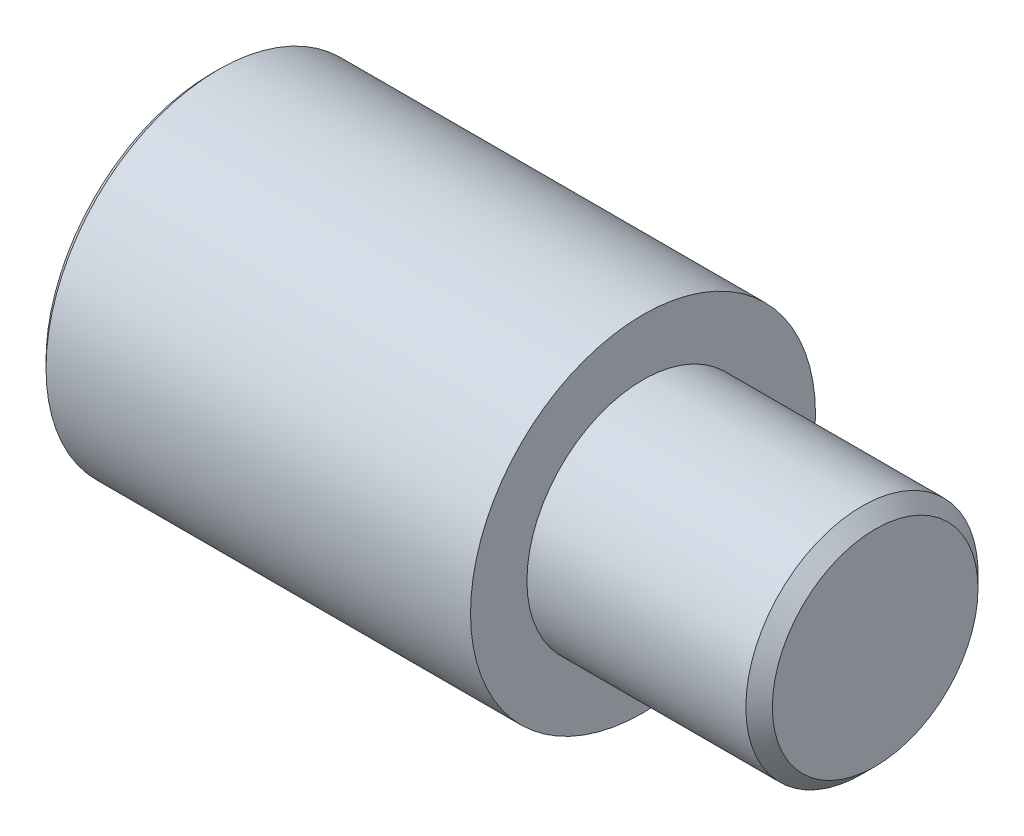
ISO-10303-21;
HEADER;
FILE_DESCRIPTION(('STEP AP214'),'2;1');
FILE_NAME('part.step','',(''),(''),'','','');
FILE_SCHEMA(('AUTOMOTIVE_DESIGN { 1 0 10303 214 1 1 1 1 }'));
ENDSEC;
DATA;
#1=APPLICATION_CONTEXT('core data for automotive mechanical design processes');
#2=APPLICATION_PROTOCOL_DEFINITION('international standard','automotive_design',2000,#1);
#3=PRODUCT_CONTEXT('',#1,'mechanical');
#4=PRODUCT('Part','Part','',(#3));
#5=PRODUCT_RELATED_PRODUCT_CATEGORY('part','',(#4));
#6=PRODUCT_DEFINITION_FORMATION('','',#4);
#7=PRODUCT_DEFINITION_CONTEXT('part definition',#1,'design');
#8=PRODUCT_DEFINITION('design','',#6,#7);
#9=PRODUCT_DEFINITION_SHAPE('','',#8);
#10=(LENGTH_UNIT() NAMED_UNIT(*) SI_UNIT(.MILLI.,.METRE.));
#11=(NAMED_UNIT(*) PLANE_ANGLE_UNIT() SI_UNIT($,.RADIAN.));
#12=(NAMED_UNIT(*) SI_UNIT($,.STERADIAN.) SOLID_ANGLE_UNIT());
#13=UNCERTAINTY_MEASURE_WITH_UNIT(LENGTH_MEASURE(1.E-05),#10,'distance_accuracy_value','');
#14=(GEOMETRIC_REPRESENTATION_CONTEXT(3) GLOBAL_UNCERTAINTY_ASSIGNED_CONTEXT((#13)) GLOBAL_UNIT_ASSIGNED_CONTEXT((#10,
#11,#12)) REPRESENTATION_CONTEXT('',''));
#15=CARTESIAN_POINT('',(0.,0.,0.));
#16=DIRECTION('',(0.,0.,1.));
#17=DIRECTION('',(1.,0.,0.));
#18=AXIS2_PLACEMENT_3D('',#15,#16,#17);
#19=CARTESIAN_POINT('',(2.50000000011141,0.,0.));
#20=DIRECTION('',(-1.,0.,0.));
#21=DIRECTION('',(0.,0.,1.));
#22=AXIS2_PLACEMENT_3D('',#19,#20,#21);
#23=CONICAL_SURFACE('',#22,1.99999999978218,1.0297442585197);
#24=CARTESIAN_POINT('',(3.70172123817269,0.,-2.55795384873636E-10));
#25=VERTEX_POINT('',#24);
#26=VERTEX_LOOP('',#25);
#27=FACE_BOUND('',#26,.T.);
#28=CARTESIAN_POINT('',(2.5,0.,0.));
#29=DIRECTION('',(-1.,0.,0.));
#30=DIRECTION('',(0.,0.,1.));
#31=AXIS2_PLACEMENT_3D('',#28,#29,#30);
#32=CIRCLE('',#31,2.);
#33=CARTESIAN_POINT('',(2.5,0.,2.));
#34=VERTEX_POINT('',#33);
#35=EDGE_CURVE('E35',#34,#34,#32,.T.);
#36=ORIENTED_EDGE('',*,*,#35,.T.);
#37=EDGE_LOOP('',(#36));
#38=FACE_BOUND('',#37,.T.);
#39=ADVANCED_FACE('F17',(#27,#38),#23,.F.);
#40=CARTESIAN_POINT('',(10.,1.75,0.));
#41=DIRECTION('',(-1.,0.,0.));
#42=DIRECTION('',(0.,0.,1.));
#43=AXIS2_PLACEMENT_3D('',#40,#41,#42);
#44=PLANE('',#43);
#45=CARTESIAN_POINT('',(9.99999999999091,0.,0.));
#46=DIRECTION('',(-1.,0.,0.));
#47=DIRECTION('',(0.,0.,1.));
#48=AXIS2_PLACEMENT_3D('',#45,#46,#47);
#49=CIRCLE('',#48,1.55000000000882);
#50=CARTESIAN_POINT('',(9.99999999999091,0.,1.55000000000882));
#51=VERTEX_POINT('',#50);
#52=EDGE_CURVE('E21',#51,#51,#49,.T.);
#53=ORIENTED_EDGE('',*,*,#52,.F.);
#54=EDGE_LOOP('',(#53));
#55=FACE_BOUND('',#54,.T.);
#56=ADVANCED_FACE('F31',(#55),#44,.F.);
#57=CARTESIAN_POINT('',(0.,0.,0.));
#58=DIRECTION('',(-1.,0.,0.));
#59=DIRECTION('',(0.,0.,1.));
#60=AXIS2_PLACEMENT_3D('',#57,#58,#59);
#61=CYLINDRICAL_SURFACE('',#60,2.);
#62=CARTESIAN_POINT('',(0.100000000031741,0.,0.));
#63=DIRECTION('',(-1.,0.,0.));
#64=DIRECTION('',(0.,0.,1.));
#65=AXIS2_PLACEMENT_3D('',#62,#63,#64);
#66=CIRCLE('',#65,2.00000000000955);
#67=CARTESIAN_POINT('',(0.100000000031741,0.,2.00000000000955));
#68=VERTEX_POINT('',#67);
#69=EDGE_CURVE('E39',#68,#68,#66,.T.);
#70=ORIENTED_EDGE('',*,*,#69,.T.);
#71=EDGE_LOOP('',(#70));
#72=FACE_BOUND('',#71,.T.);
#73=ORIENTED_EDGE('',*,*,#35,.F.);
#74=EDGE_LOOP('',(#73));
#75=FACE_BOUND('',#74,.T.);
#76=ADVANCED_FACE('F61',(#72,#75),#61,.F.);
#77=CARTESIAN_POINT('',(9.8000000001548,0.,0.));
#78=DIRECTION('',(-1.,0.,0.));
#79=DIRECTION('',(0.,0.,1.));
#80=AXIS2_PLACEMENT_3D('',#77,#78,#79);
#81=CONICAL_SURFACE('',#80,1.74999999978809,0.78539816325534);
#82=CARTESIAN_POINT('',(9.8,0.,0.));
#83=DIRECTION('',(-1.,0.,0.));
#84=DIRECTION('',(0.,0.,1.));
#85=AXIS2_PLACEMENT_3D('',#82,#83,#84);
#86=CIRCLE('',#85,1.75);
#87=CARTESIAN_POINT('',(9.8,0.,1.75));
#88=VERTEX_POINT('',#87);
#89=EDGE_CURVE('E52',#88,#88,#86,.T.);
#90=ORIENTED_EDGE('',*,*,#89,.F.);
#91=EDGE_LOOP('',(#90));
#92=FACE_BOUND('',#91,.T.);
#93=ORIENTED_EDGE('',*,*,#52,.T.);
#94=EDGE_LOOP('',(#93));
#95=FACE_BOUND('',#94,.T.);
#96=ADVANCED_FACE('F66',(#92,#95),#81,.T.);
#97=CARTESIAN_POINT('',(1.13686837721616E-10,0.,0.));
#98=DIRECTION('',(-1.,0.,0.));
#99=DIRECTION('',(0.,0.,1.));
#100=AXIS2_PLACEMENT_3D('',#97,#98,#99);
#101=CONICAL_SURFACE('',#100,2.0999999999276,0.785398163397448);
#102=CARTESIAN_POINT('',(0.,0.,0.));
#103=DIRECTION('',(-1.,0.,0.));
#104=DIRECTION('',(0.,0.,1.));
#105=AXIS2_PLACEMENT_3D('',#102,#103,#104);
#106=CIRCLE('',#105,2.10000000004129);
#107=CARTESIAN_POINT('',(0.,0.,2.10000000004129));
#108=VERTEX_POINT('',#107);
#109=EDGE_CURVE('E50',#108,#108,#106,.T.);
#110=ORIENTED_EDGE('',*,*,#109,.T.);
#111=EDGE_LOOP('',(#110));
#112=FACE_BOUND('',#111,.T.);
#113=ORIENTED_EDGE('',*,*,#69,.F.);
#114=EDGE_LOOP('',(#113));
#115=FACE_BOUND('',#114,.T.);
#116=ADVANCED_FACE('F63',(#112,#115),#101,.F.);
#117=CARTESIAN_POINT('',(0.,0.,0.));
#118=DIRECTION('',(-1.,0.,0.));
#119=DIRECTION('',(0.,0.,1.));
#120=AXIS2_PLACEMENT_3D('',#117,#118,#119);
#121=CYLINDRICAL_SURFACE('',#120,1.75);
#122=CARTESIAN_POINT('',(6.5,0.,0.));
#123=DIRECTION('',(-1.,0.,0.));
#124=DIRECTION('',(0.,0.,1.));
#125=AXIS2_PLACEMENT_3D('',#122,#123,#124);
#126=CIRCLE('',#125,1.75);
#127=CARTESIAN_POINT('',(6.5,0.,1.75));
#128=VERTEX_POINT('',#127);
#129=EDGE_CURVE('E48',#128,#128,#126,.F.);
#130=ORIENTED_EDGE('',*,*,#129,.T.);
#131=EDGE_LOOP('',(#130));
#132=FACE_BOUND('',#131,.T.);
#133=ORIENTED_EDGE('',*,*,#89,.T.);
#134=EDGE_LOOP('',(#133));
#135=FACE_BOUND('',#134,.T.);
#136=ADVANCED_FACE('F65',(#132,#135),#121,.T.);
#137=CARTESIAN_POINT('',(0.,0.,0.));
#138=DIRECTION('',(1.,0.,0.));
#139=DIRECTION('',(0.,0.,-1.));
#140=AXIS2_PLACEMENT_3D('',#137,#138,#139);
#141=PLANE('',#140);
#142=ORIENTED_EDGE('',*,*,#109,.F.);
#143=EDGE_LOOP('',(#142));
#144=FACE_BOUND('',#143,.T.);
#145=CARTESIAN_POINT('',(5.6843418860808E-11,0.,0.));
#146=DIRECTION('',(1.,0.,0.));
#147=DIRECTION('',(0.,1.,0.));
#148=AXIS2_PLACEMENT_3D('',#145,#146,#147);
#149=CIRCLE('',#148,2.49999999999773);
#150=CARTESIAN_POINT('',(5.684341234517E-11,2.49999999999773,0.));
#151=VERTEX_POINT('',#150);
#152=EDGE_CURVE('E45',#151,#151,#149,.T.);
#153=ORIENTED_EDGE('',*,*,#152,.F.);
#154=EDGE_LOOP('',(#153));
#155=FACE_BOUND('',#154,.T.);
#156=ADVANCED_FACE('F73',(#144,#155),#141,.F.);
#157=CARTESIAN_POINT('',(6.5,2.6,0.));
#158=DIRECTION('',(-1.,0.,0.));
#159=DIRECTION('',(0.,0.,1.));
#160=AXIS2_PLACEMENT_3D('',#157,#158,#159);
#161=PLANE('',#160);
#162=ORIENTED_EDGE('',*,*,#129,.F.);
#163=EDGE_LOOP('',(#162));
#164=FACE_BOUND('',#163,.T.);
#165=CARTESIAN_POINT('',(6.5,0.,0.));
#166=DIRECTION('',(-1.,0.,0.));
#167=DIRECTION('',(0.,0.,1.));
#168=AXIS2_PLACEMENT_3D('',#165,#166,#167);
#169=CIRCLE('',#168,2.6);
#170=CARTESIAN_POINT('',(6.5,0.,2.6));
#171=VERTEX_POINT('',#170);
#172=EDGE_CURVE('E25',#171,#171,#169,.T.);
#173=ORIENTED_EDGE('',*,*,#172,.F.);
#174=EDGE_LOOP('',(#173));
#175=FACE_BOUND('',#174,.T.);
#176=ADVANCED_FACE('F86',(#164,#175),#161,.F.);
#177=CARTESIAN_POINT('',(0.0999999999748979,0.,0.));
#178=DIRECTION('',(1.,0.,0.));
#179=DIRECTION('',(0.,1.,0.));
#180=AXIS2_PLACEMENT_3D('',#177,#178,#179);
#181=CONICAL_SURFACE('',#180,2.59999999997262,0.785398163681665);
#182=CARTESIAN_POINT('',(0.100000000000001,0.,0.));
#183=DIRECTION('',(-1.,0.,0.));
#184=DIRECTION('',(0.,0.,1.));
#185=AXIS2_PLACEMENT_3D('',#182,#183,#184);
#186=CIRCLE('',#185,2.6);
#187=CARTESIAN_POINT('',(0.100000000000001,0.,2.6));
#188=VERTEX_POINT('',#187);
#189=EDGE_CURVE('E11',#188,#188,#186,.F.);
#190=ORIENTED_EDGE('',*,*,#189,.F.);
#191=EDGE_LOOP('',(#190));
#192=FACE_BOUND('',#191,.T.);
#193=ORIENTED_EDGE('',*,*,#152,.T.);
#194=EDGE_LOOP('',(#193));
#195=FACE_BOUND('',#194,.T.);
#196=ADVANCED_FACE('F80',(#192,#195),#181,.T.);
#197=CARTESIAN_POINT('',(0.,0.,0.));
#198=DIRECTION('',(-1.,0.,0.));
#199=DIRECTION('',(0.,0.,1.));
#200=AXIS2_PLACEMENT_3D('',#197,#198,#199);
#201=CYLINDRICAL_SURFACE('',#200,2.6);
#202=ORIENTED_EDGE('',*,*,#172,.T.);
#203=EDGE_LOOP('',(#202));
#204=FACE_BOUND('',#203,.T.);
#205=ORIENTED_EDGE('',*,*,#189,.T.);
#206=EDGE_LOOP('',(#205));
#207=FACE_BOUND('',#206,.T.);
#208=ADVANCED_FACE('F19',(#204,#207),#201,.T.);
#209=CLOSED_SHELL('',(#39,#56,#76,#96,#116,#136,#156,#176,#196,#208));
#210=MANIFOLD_SOLID_BREP('B1',#209);
#211=ADVANCED_BREP_SHAPE_REPRESENTATION('',(#18,#210),#14);
#212=SHAPE_DEFINITION_REPRESENTATION(#9,#211);
ENDSEC;
END-ISO-10303-21;
